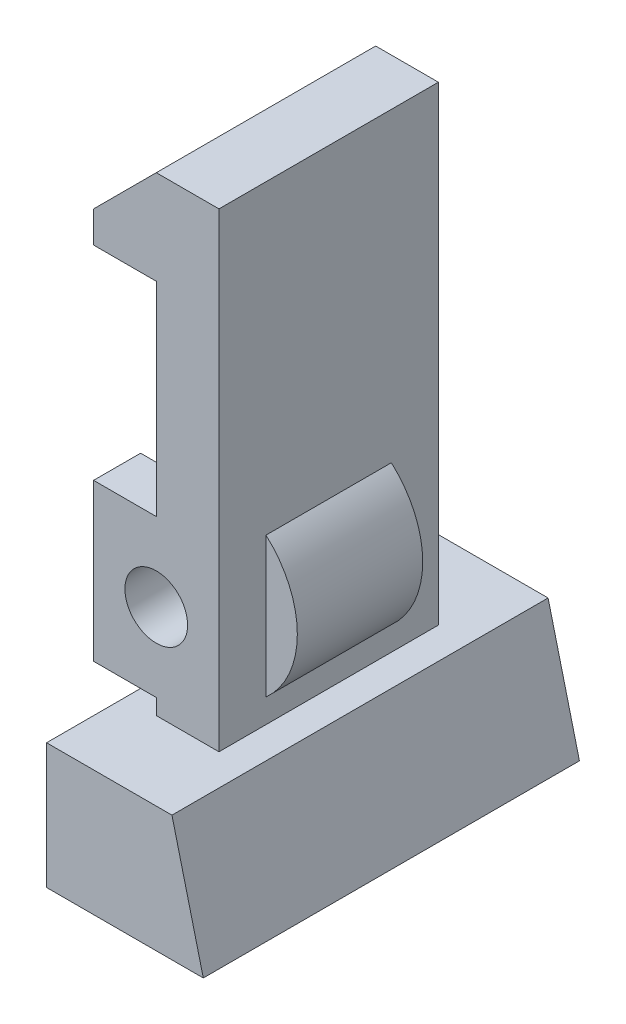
ISO-10303-21;
HEADER;
FILE_DESCRIPTION(('STEP AP214'),'2;1');
FILE_NAME('part.step','',(''),(''),'','','');
FILE_SCHEMA(('AUTOMOTIVE_DESIGN { 1 0 10303 214 1 1 1 1 }'));
ENDSEC;
DATA;
#1=APPLICATION_CONTEXT('core data for automotive mechanical design processes');
#2=APPLICATION_PROTOCOL_DEFINITION('international standard','automotive_design',2000,#1);
#3=PRODUCT_CONTEXT('',#1,'mechanical');
#4=PRODUCT('Part','Part','',(#3));
#5=PRODUCT_RELATED_PRODUCT_CATEGORY('part','',(#4));
#6=PRODUCT_DEFINITION_FORMATION('','',#4);
#7=PRODUCT_DEFINITION_CONTEXT('part definition',#1,'design');
#8=PRODUCT_DEFINITION('design','',#6,#7);
#9=PRODUCT_DEFINITION_SHAPE('','',#8);
#10=(LENGTH_UNIT() NAMED_UNIT(*) SI_UNIT(.MILLI.,.METRE.));
#11=(NAMED_UNIT(*) PLANE_ANGLE_UNIT() SI_UNIT($,.RADIAN.));
#12=(NAMED_UNIT(*) SI_UNIT($,.STERADIAN.) SOLID_ANGLE_UNIT());
#13=UNCERTAINTY_MEASURE_WITH_UNIT(LENGTH_MEASURE(1.E-05),#10,'distance_accuracy_value','');
#14=(GEOMETRIC_REPRESENTATION_CONTEXT(3) GLOBAL_UNCERTAINTY_ASSIGNED_CONTEXT((#13)) GLOBAL_UNIT_ASSIGNED_CONTEXT((#10,
#11,#12)) REPRESENTATION_CONTEXT('',''));
#15=CARTESIAN_POINT('',(0.,0.,0.));
#16=DIRECTION('',(0.,0.,1.));
#17=DIRECTION('',(1.,0.,0.));
#18=AXIS2_PLACEMENT_3D('',#15,#16,#17);
#19=CARTESIAN_POINT('',(0.,0.,3.5));
#20=DIRECTION('',(1.,0.,0.));
#21=DIRECTION('',(0.,1.,0.));
#22=AXIS2_PLACEMENT_3D('',#19,#20,#21);
#23=PLANE('',#22);
#24=DIRECTION('',(0.,1.,0.));
#25=VECTOR('',#24,1.);
#26=CARTESIAN_POINT('',(0.,2.5,-2.));
#27=LINE('',#26,#25);
#28=CARTESIAN_POINT('',(0.,1.,-2.));
#29=VERTEX_POINT('',#28);
#30=CARTESIAN_POINT('',(0.,2.5,-2.));
#31=VERTEX_POINT('',#30);
#32=EDGE_CURVE('E199',#29,#31,#27,.T.);
#33=ORIENTED_EDGE('',*,*,#32,.F.);
#34=DIRECTION('',(0.,0.,1.));
#35=VECTOR('',#34,1.);
#36=CARTESIAN_POINT('',(0.,1.,-6.00000000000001));
#37=LINE('',#36,#35);
#38=CARTESIAN_POINT('',(0.,1.,2.));
#39=VERTEX_POINT('',#38);
#40=EDGE_CURVE('E45',#29,#39,#37,.T.);
#41=ORIENTED_EDGE('',*,*,#40,.T.);
#42=DIRECTION('',(0.,1.,0.));
#43=VECTOR('',#42,1.);
#44=CARTESIAN_POINT('',(0.,2.5,2.));
#45=LINE('',#44,#43);
#46=CARTESIAN_POINT('',(0.,2.5,2.));
#47=VERTEX_POINT('',#46);
#48=EDGE_CURVE('E231',#39,#47,#45,.T.);
#49=ORIENTED_EDGE('',*,*,#48,.T.);
#50=DIRECTION('',(0.,0.,1.));
#51=VECTOR('',#50,1.);
#52=CARTESIAN_POINT('',(0.,2.5,2.));
#53=LINE('',#52,#51);
#54=CARTESIAN_POINT('',(0.,2.5,3.5));
#55=VERTEX_POINT('',#54);
#56=EDGE_CURVE('E240',#47,#55,#53,.T.);
#57=ORIENTED_EDGE('',*,*,#56,.T.);
#58=DIRECTION('',(0.,-1.,0.));
#59=VECTOR('',#58,1.);
#60=CARTESIAN_POINT('',(0.,-3.,3.5));
#61=LINE('',#60,#59);
#62=CARTESIAN_POINT('',(0.,9.,3.5));
#63=VERTEX_POINT('',#62);
#64=EDGE_CURVE('E309',#63,#55,#61,.T.);
#65=ORIENTED_EDGE('',*,*,#64,.F.);
#66=DIRECTION('',(0.,0.,-1.));
#67=VECTOR('',#66,1.);
#68=CARTESIAN_POINT('',(0.,9.,3.5));
#69=LINE('',#68,#67);
#70=CARTESIAN_POINT('',(0.,9.,-3.5));
#71=VERTEX_POINT('',#70);
#72=EDGE_CURVE('E325',#63,#71,#69,.T.);
#73=ORIENTED_EDGE('',*,*,#72,.T.);
#74=DIRECTION('',(0.,-1.,0.));
#75=VECTOR('',#74,1.);
#76=CARTESIAN_POINT('',(0.,0.,-3.5));
#77=LINE('',#76,#75);
#78=CARTESIAN_POINT('',(0.,2.5,-3.5));
#79=VERTEX_POINT('',#78);
#80=EDGE_CURVE('E306',#71,#79,#77,.T.);
#81=ORIENTED_EDGE('',*,*,#80,.T.);
#82=DIRECTION('',(0.,0.,-1.));
#83=VECTOR('',#82,1.);
#84=CARTESIAN_POINT('',(0.,2.5,-2.));
#85=LINE('',#84,#83);
#86=EDGE_CURVE('E213',#31,#79,#85,.T.);
#87=ORIENTED_EDGE('',*,*,#86,.F.);
#88=EDGE_LOOP('',(#33,#41,#49,#57,#65,#73,#81,#87));
#89=FACE_BOUND('',#88,.T.);
#90=ADVANCED_FACE('F31',(#89),#23,.F.);
#91=CARTESIAN_POINT('',(0.,-2.5,2.));
#92=VERTEX_POINT('',#91);
#93=CARTESIAN_POINT('',(0.,-1.,2.));
#94=VERTEX_POINT('',#93);
#95=EDGE_CURVE('E193',#92,#94,#45,.T.);
#96=ORIENTED_EDGE('',*,*,#95,.T.);
#97=DIRECTION('',(0.,0.,1.));
#98=VECTOR('',#97,1.);
#99=CARTESIAN_POINT('',(0.,-1.,-6.00000000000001));
#100=LINE('',#99,#98);
#101=CARTESIAN_POINT('',(0.,-1.,-2.));
#102=VERTEX_POINT('',#101);
#103=EDGE_CURVE('E186',#94,#102,#100,.F.);
#104=ORIENTED_EDGE('',*,*,#103,.T.);
#105=CARTESIAN_POINT('',(0.,-2.5,-2.));
#106=VERTEX_POINT('',#105);
#107=EDGE_CURVE('E53',#106,#102,#27,.T.);
#108=ORIENTED_EDGE('',*,*,#107,.F.);
#109=DIRECTION('',(0.,0.,-1.));
#110=VECTOR('',#109,1.);
#111=CARTESIAN_POINT('',(0.,-2.5,-2.));
#112=LINE('',#111,#110);
#113=CARTESIAN_POINT('',(0.,-2.5,-3.5));
#114=VERTEX_POINT('',#113);
#115=EDGE_CURVE('E211',#106,#114,#112,.T.);
#116=ORIENTED_EDGE('',*,*,#115,.T.);
#117=CARTESIAN_POINT('',(0.,-3.,-3.5));
#118=VERTEX_POINT('',#117);
#119=EDGE_CURVE('E305',#114,#118,#77,.T.);
#120=ORIENTED_EDGE('',*,*,#119,.T.);
#121=DIRECTION('',(0.,0.,-1.));
#122=VECTOR('',#121,1.);
#123=CARTESIAN_POINT('',(0.,-3.,3.5));
#124=LINE('',#123,#122);
#125=CARTESIAN_POINT('',(0.,-3.,3.5));
#126=VERTEX_POINT('',#125);
#127=EDGE_CURVE('E39',#126,#118,#124,.T.);
#128=ORIENTED_EDGE('',*,*,#127,.F.);
#129=CARTESIAN_POINT('',(0.,-2.5,3.5));
#130=VERTEX_POINT('',#129);
#131=EDGE_CURVE('E308',#130,#126,#61,.T.);
#132=ORIENTED_EDGE('',*,*,#131,.F.);
#133=DIRECTION('',(0.,0.,1.));
#134=VECTOR('',#133,1.);
#135=CARTESIAN_POINT('',(0.,-2.5,2.));
#136=LINE('',#135,#134);
#137=EDGE_CURVE('E243',#92,#130,#136,.T.);
#138=ORIENTED_EDGE('',*,*,#137,.F.);
#139=EDGE_LOOP('',(#96,#104,#108,#116,#120,#128,#132,#138));
#140=FACE_BOUND('',#139,.T.);
#141=ADVANCED_FACE('F191',(#140),#23,.F.);
#142=CARTESIAN_POINT('',(2.,12.,3.5));
#143=DIRECTION('',(-1.,0.,0.));
#144=DIRECTION('',(0.,-1.,0.));
#145=AXIS2_PLACEMENT_3D('',#142,#143,#144);
#146=PLANE('',#145);
#147=DIRECTION('',(0.,0.,-1.));
#148=VECTOR('',#147,1.);
#149=CARTESIAN_POINT('',(2.,-2.23606797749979,2.));
#150=LINE('',#149,#148);
#151=CARTESIAN_POINT('',(2.,-2.23606797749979,2.));
#152=VERTEX_POINT('',#151);
#153=CARTESIAN_POINT('',(2.,-2.23606797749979,-2.));
#154=VERTEX_POINT('',#153);
#155=EDGE_CURVE('E257',#152,#154,#150,.T.);
#156=ORIENTED_EDGE('',*,*,#155,.F.);
#157=DIRECTION('',(0.,1.,0.));
#158=VECTOR('',#157,1.);
#159=CARTESIAN_POINT('',(2.,12.,2.));
#160=LINE('',#159,#158);
#161=CARTESIAN_POINT('',(2.,2.23606797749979,2.));
#162=VERTEX_POINT('',#161);
#163=EDGE_CURVE('E255',#152,#162,#160,.T.);
#164=ORIENTED_EDGE('',*,*,#163,.T.);
#165=DIRECTION('',(0.,0.,-1.));
#166=VECTOR('',#165,1.);
#167=CARTESIAN_POINT('',(2.,2.23606797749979,2.));
#168=LINE('',#167,#166);
#169=CARTESIAN_POINT('',(2.,2.23606797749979,-2.));
#170=VERTEX_POINT('',#169);
#171=EDGE_CURVE('E260',#170,#162,#168,.F.);
#172=ORIENTED_EDGE('',*,*,#171,.F.);
#173=DIRECTION('',(0.,1.,0.));
#174=VECTOR('',#173,1.);
#175=CARTESIAN_POINT('',(2.,12.,-2.));
#176=LINE('',#175,#174);
#177=EDGE_CURVE('E252',#154,#170,#176,.T.);
#178=ORIENTED_EDGE('',*,*,#177,.F.);
#179=EDGE_LOOP('',(#156,#164,#172,#178));
#180=FACE_BOUND('',#179,.T.);
#181=DIRECTION('',(0.,1.,0.));
#182=VECTOR('',#181,1.);
#183=CARTESIAN_POINT('',(2.,12.,-3.5));
#184=LINE('',#183,#182);
#185=CARTESIAN_POINT('',(2.,-3.,-3.5));
#186=VERTEX_POINT('',#185);
#187=CARTESIAN_POINT('',(2.,12.,-3.5));
#188=VERTEX_POINT('',#187);
#189=EDGE_CURVE('E295',#186,#188,#184,.T.);
#190=ORIENTED_EDGE('',*,*,#189,.T.);
#191=DIRECTION('',(0.,0.,-1.));
#192=VECTOR('',#191,1.);
#193=CARTESIAN_POINT('',(2.,12.,3.5));
#194=LINE('',#193,#192);
#195=CARTESIAN_POINT('',(2.,12.,3.5));
#196=VERTEX_POINT('',#195);
#197=EDGE_CURVE('E337',#196,#188,#194,.T.);
#198=ORIENTED_EDGE('',*,*,#197,.F.);
#199=DIRECTION('',(0.,1.,0.));
#200=VECTOR('',#199,1.);
#201=CARTESIAN_POINT('',(2.,12.,3.5));
#202=LINE('',#201,#200);
#203=CARTESIAN_POINT('',(2.,-3.,3.5));
#204=VERTEX_POINT('',#203);
#205=EDGE_CURVE('E314',#204,#196,#202,.T.);
#206=ORIENTED_EDGE('',*,*,#205,.F.);
#207=DIRECTION('',(0.,0.,-1.));
#208=VECTOR('',#207,1.);
#209=CARTESIAN_POINT('',(2.,-3.,3.5));
#210=LINE('',#209,#208);
#211=EDGE_CURVE('E340',#204,#186,#210,.T.);
#212=ORIENTED_EDGE('',*,*,#211,.T.);
#213=EDGE_LOOP('',(#190,#198,#206,#212));
#214=FACE_BOUND('',#213,.T.);
#215=ADVANCED_FACE('F33',(#180,#214),#146,.F.);
#216=CARTESIAN_POINT('',(0.,12.,3.5));
#217=DIRECTION('',(0.,-1.,0.));
#218=DIRECTION('',(0.,0.,-1.));
#219=AXIS2_PLACEMENT_3D('',#216,#217,#218);
#220=PLANE('',#219);
#221=DIRECTION('',(-1.,0.,0.));
#222=VECTOR('',#221,1.);
#223=CARTESIAN_POINT('',(0.,12.,-3.5));
#224=LINE('',#223,#222);
#225=CARTESIAN_POINT('',(0.,12.,-3.5));
#226=VERTEX_POINT('',#225);
#227=EDGE_CURVE('E297',#188,#226,#224,.T.);
#228=ORIENTED_EDGE('',*,*,#227,.T.);
#229=DIRECTION('',(0.,0.,-1.));
#230=VECTOR('',#229,1.);
#231=CARTESIAN_POINT('',(0.,12.,3.5));
#232=LINE('',#231,#230);
#233=CARTESIAN_POINT('',(0.,12.,3.5));
#234=VERTEX_POINT('',#233);
#235=EDGE_CURVE('E334',#234,#226,#232,.T.);
#236=ORIENTED_EDGE('',*,*,#235,.F.);
#237=DIRECTION('',(-1.,0.,0.));
#238=VECTOR('',#237,1.);
#239=CARTESIAN_POINT('',(0.,12.,3.5));
#240=LINE('',#239,#238);
#241=EDGE_CURVE('E316',#196,#234,#240,.T.);
#242=ORIENTED_EDGE('',*,*,#241,.F.);
#243=ORIENTED_EDGE('',*,*,#197,.T.);
#244=EDGE_LOOP('',(#228,#236,#242,#243));
#245=FACE_BOUND('',#244,.T.);
#246=ADVANCED_FACE('F424',(#245),#220,.F.);
#247=CARTESIAN_POINT('',(-2.,9.99999999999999,3.5));
#248=DIRECTION('',(0.707106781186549,-0.707106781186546,0.));
#249=DIRECTION('',(0.707106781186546,0.707106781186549,0.));
#250=AXIS2_PLACEMENT_3D('',#247,#248,#249);
#251=PLANE('',#250);
#252=DIRECTION('',(-0.707106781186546,-0.707106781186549,0.));
#253=VECTOR('',#252,1.);
#254=CARTESIAN_POINT('',(-2.,9.99999999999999,-3.5));
#255=LINE('',#254,#253);
#256=CARTESIAN_POINT('',(-2.,9.99999999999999,-3.5));
#257=VERTEX_POINT('',#256);
#258=EDGE_CURVE('E299',#226,#257,#255,.T.);
#259=ORIENTED_EDGE('',*,*,#258,.T.);
#260=DIRECTION('',(0.,0.,-1.));
#261=VECTOR('',#260,1.);
#262=CARTESIAN_POINT('',(-2.,9.99999999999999,3.5));
#263=LINE('',#262,#261);
#264=CARTESIAN_POINT('',(-2.,9.99999999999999,3.5));
#265=VERTEX_POINT('',#264);
#266=EDGE_CURVE('E331',#265,#257,#263,.T.);
#267=ORIENTED_EDGE('',*,*,#266,.F.);
#268=DIRECTION('',(-0.707106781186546,-0.707106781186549,0.));
#269=VECTOR('',#268,1.);
#270=CARTESIAN_POINT('',(-2.,9.99999999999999,3.5));
#271=LINE('',#270,#269);
#272=EDGE_CURVE('E318',#234,#265,#271,.T.);
#273=ORIENTED_EDGE('',*,*,#272,.F.);
#274=ORIENTED_EDGE('',*,*,#235,.T.);
#275=EDGE_LOOP('',(#259,#267,#273,#274));
#276=FACE_BOUND('',#275,.T.);
#277=ADVANCED_FACE('F421',(#276),#251,.F.);
#278=CARTESIAN_POINT('',(-2.,9.,3.5));
#279=DIRECTION('',(1.,0.,0.));
#280=DIRECTION('',(0.,0.,-1.));
#281=AXIS2_PLACEMENT_3D('',#278,#279,#280);
#282=PLANE('',#281);
#283=DIRECTION('',(0.,-1.,0.));
#284=VECTOR('',#283,1.);
#285=CARTESIAN_POINT('',(-2.,9.,-3.5));
#286=LINE('',#285,#284);
#287=CARTESIAN_POINT('',(-2.,9.,-3.5));
#288=VERTEX_POINT('',#287);
#289=EDGE_CURVE('E301',#257,#288,#286,.T.);
#290=ORIENTED_EDGE('',*,*,#289,.T.);
#291=DIRECTION('',(0.,0.,-1.));
#292=VECTOR('',#291,1.);
#293=CARTESIAN_POINT('',(-2.,9.,3.5));
#294=LINE('',#293,#292);
#295=CARTESIAN_POINT('',(-2.,9.,3.5));
#296=VERTEX_POINT('',#295);
#297=EDGE_CURVE('E328',#296,#288,#294,.T.);
#298=ORIENTED_EDGE('',*,*,#297,.F.);
#299=DIRECTION('',(0.,-1.,0.));
#300=VECTOR('',#299,1.);
#301=CARTESIAN_POINT('',(-2.,9.,3.5));
#302=LINE('',#301,#300);
#303=EDGE_CURVE('E320',#265,#296,#302,.T.);
#304=ORIENTED_EDGE('',*,*,#303,.F.);
#305=ORIENTED_EDGE('',*,*,#266,.T.);
#306=EDGE_LOOP('',(#290,#298,#304,#305));
#307=FACE_BOUND('',#306,.T.);
#308=ADVANCED_FACE('F418',(#307),#282,.F.);
#309=CARTESIAN_POINT('',(0.,9.,3.5));
#310=DIRECTION('',(0.,1.,0.));
#311=DIRECTION('',(-1.,0.,0.));
#312=AXIS2_PLACEMENT_3D('',#309,#310,#311);
#313=PLANE('',#312);
#314=DIRECTION('',(1.,0.,0.));
#315=VECTOR('',#314,1.);
#316=CARTESIAN_POINT('',(0.,9.,-3.5));
#317=LINE('',#316,#315);
#318=EDGE_CURVE('E303',#288,#71,#317,.T.);
#319=ORIENTED_EDGE('',*,*,#318,.T.);
#320=ORIENTED_EDGE('',*,*,#72,.F.);
#321=DIRECTION('',(1.,0.,0.));
#322=VECTOR('',#321,1.);
#323=CARTESIAN_POINT('',(0.,9.,3.5));
#324=LINE('',#323,#322);
#325=EDGE_CURVE('E322',#296,#63,#324,.T.);
#326=ORIENTED_EDGE('',*,*,#325,.F.);
#327=ORIENTED_EDGE('',*,*,#297,.T.);
#328=EDGE_LOOP('',(#319,#320,#326,#327));
#329=FACE_BOUND('',#328,.T.);
#330=ADVANCED_FACE('F414',(#329),#313,.F.);
#331=CARTESIAN_POINT('',(0.,12.,3.5));
#332=DIRECTION('',(0.,0.,-1.));
#333=DIRECTION('',(-1.,0.,0.));
#334=AXIS2_PLACEMENT_3D('',#331,#332,#333);
#335=PLANE('',#334);
#336=CARTESIAN_POINT('',(0.,0.,3.5));
#337=DIRECTION('',(0.,0.,-1.));
#338=DIRECTION('',(-1.,0.,0.));
#339=AXIS2_PLACEMENT_3D('',#336,#337,#338);
#340=CIRCLE('',#339,1.);
#341=CARTESIAN_POINT('',(-1.,0.,3.5));
#342=VERTEX_POINT('',#341);
#343=EDGE_CURVE('E385',#342,#342,#340,.T.);
#344=ORIENTED_EDGE('',*,*,#343,.T.);
#345=EDGE_LOOP('',(#344));
#346=FACE_BOUND('',#345,.T.);
#347=ORIENTED_EDGE('',*,*,#64,.T.);
#348=DIRECTION('',(-1.,0.,0.));
#349=VECTOR('',#348,1.);
#350=CARTESIAN_POINT('',(0.,2.5,3.5));
#351=LINE('',#350,#349);
#352=CARTESIAN_POINT('',(-2.,2.5,3.5));
#353=VERTEX_POINT('',#352);
#354=EDGE_CURVE('E222',#55,#353,#351,.T.);
#355=ORIENTED_EDGE('',*,*,#354,.T.);
#356=DIRECTION('',(0.,-1.,0.));
#357=VECTOR('',#356,1.);
#358=CARTESIAN_POINT('',(-2.,2.5,3.5));
#359=LINE('',#358,#357);
#360=CARTESIAN_POINT('',(-2.,-2.5,3.5));
#361=VERTEX_POINT('',#360);
#362=EDGE_CURVE('E210',#353,#361,#359,.T.);
#363=ORIENTED_EDGE('',*,*,#362,.T.);
#364=DIRECTION('',(1.,0.,0.));
#365=VECTOR('',#364,1.);
#366=CARTESIAN_POINT('',(-2.,-2.5,3.5));
#367=LINE('',#366,#365);
#368=EDGE_CURVE('E220',#361,#130,#367,.T.);
#369=ORIENTED_EDGE('',*,*,#368,.T.);
#370=ORIENTED_EDGE('',*,*,#131,.T.);
#371=DIRECTION('',(1.,0.,0.));
#372=VECTOR('',#371,1.);
#373=CARTESIAN_POINT('',(2.,-3.,3.5));
#374=LINE('',#373,#372);
#375=EDGE_CURVE('E312',#126,#204,#374,.T.);
#376=ORIENTED_EDGE('',*,*,#375,.T.);
#377=ORIENTED_EDGE('',*,*,#205,.T.);
#378=ORIENTED_EDGE('',*,*,#241,.T.);
#379=ORIENTED_EDGE('',*,*,#272,.T.);
#380=ORIENTED_EDGE('',*,*,#303,.T.);
#381=ORIENTED_EDGE('',*,*,#325,.T.);
#382=EDGE_LOOP('',(#347,#355,#363,#369,#370,#376,#377,#378,#379,#380,#381));
#383=FACE_BOUND('',#382,.T.);
#384=ADVANCED_FACE('F359',(#346,#383),#335,.F.);
#385=CARTESIAN_POINT('',(0.,12.,-3.5));
#386=DIRECTION('',(0.,0.,-1.));
#387=DIRECTION('',(-1.,0.,0.));
#388=AXIS2_PLACEMENT_3D('',#385,#386,#387);
#389=PLANE('',#388);
#390=CARTESIAN_POINT('',(0.,0.,-3.5));
#391=DIRECTION('',(0.,0.,-1.));
#392=DIRECTION('',(-1.,0.,0.));
#393=AXIS2_PLACEMENT_3D('',#390,#391,#392);
#394=CIRCLE('',#393,1.);
#395=CARTESIAN_POINT('',(-1.,0.,-3.5));
#396=VERTEX_POINT('',#395);
#397=EDGE_CURVE('E380',#396,#396,#394,.T.);
#398=ORIENTED_EDGE('',*,*,#397,.F.);
#399=EDGE_LOOP('',(#398));
#400=FACE_BOUND('',#399,.T.);
#401=DIRECTION('',(1.,0.,0.));
#402=VECTOR('',#401,1.);
#403=CARTESIAN_POINT('',(2.,-3.,-3.5));
#404=LINE('',#403,#402);
#405=EDGE_CURVE('E292',#118,#186,#404,.T.);
#406=ORIENTED_EDGE('',*,*,#405,.F.);
#407=ORIENTED_EDGE('',*,*,#119,.F.);
#408=DIRECTION('',(1.,0.,0.));
#409=VECTOR('',#408,1.);
#410=CARTESIAN_POINT('',(-2.,-2.5,-3.5));
#411=LINE('',#410,#409);
#412=CARTESIAN_POINT('',(-2.,-2.5,-3.5));
#413=VERTEX_POINT('',#412);
#414=EDGE_CURVE('E393',#413,#114,#411,.T.);
#415=ORIENTED_EDGE('',*,*,#414,.F.);
#416=DIRECTION('',(0.,-1.,0.));
#417=VECTOR('',#416,1.);
#418=CARTESIAN_POINT('',(-2.,2.5,-3.5));
#419=LINE('',#418,#417);
#420=CARTESIAN_POINT('',(-2.,2.5,-3.5));
#421=VERTEX_POINT('',#420);
#422=EDGE_CURVE('E388',#421,#413,#419,.T.);
#423=ORIENTED_EDGE('',*,*,#422,.F.);
#424=DIRECTION('',(-1.,0.,0.));
#425=VECTOR('',#424,1.);
#426=CARTESIAN_POINT('',(0.,2.5,-3.5));
#427=LINE('',#426,#425);
#428=EDGE_CURVE('E391',#79,#421,#427,.T.);
#429=ORIENTED_EDGE('',*,*,#428,.F.);
#430=ORIENTED_EDGE('',*,*,#80,.F.);
#431=ORIENTED_EDGE('',*,*,#318,.F.);
#432=ORIENTED_EDGE('',*,*,#289,.F.);
#433=ORIENTED_EDGE('',*,*,#258,.F.);
#434=ORIENTED_EDGE('',*,*,#227,.F.);
#435=ORIENTED_EDGE('',*,*,#189,.F.);
#436=EDGE_LOOP('',(#406,#407,#415,#423,#429,#430,#431,#432,#433,#434,#435));
#437=FACE_BOUND('',#436,.T.);
#438=ADVANCED_FACE('F351',(#400,#437),#389,.T.);
#439=CARTESIAN_POINT('',(2.,-3.,6.00000000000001));
#440=DIRECTION('',(0.,-1.,0.));
#441=DIRECTION('',(1.,0.,0.));
#442=AXIS2_PLACEMENT_3D('',#439,#440,#441);
#443=PLANE('',#442);
#444=DIRECTION('',(-1.,0.,0.));
#445=VECTOR('',#444,1.);
#446=CARTESIAN_POINT('',(2.,-3.,-6.00000000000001));
#447=LINE('',#446,#445);
#448=CARTESIAN_POINT('',(3.,-3.,-6.00000000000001));
#449=VERTEX_POINT('',#448);
#450=CARTESIAN_POINT('',(-1.,-3.,-6.00000000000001));
#451=VERTEX_POINT('',#450);
#452=EDGE_CURVE('E269',#449,#451,#447,.T.);
#453=ORIENTED_EDGE('',*,*,#452,.T.);
#454=DIRECTION('',(0.,0.,-1.));
#455=VECTOR('',#454,1.);
#456=CARTESIAN_POINT('',(-1.,-3.,6.00000000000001));
#457=LINE('',#456,#455);
#458=CARTESIAN_POINT('',(-1.,-3.,6.00000000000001));
#459=VERTEX_POINT('',#458);
#460=EDGE_CURVE('E289',#459,#451,#457,.T.);
#461=ORIENTED_EDGE('',*,*,#460,.F.);
#462=DIRECTION('',(-1.,0.,0.));
#463=VECTOR('',#462,1.);
#464=CARTESIAN_POINT('',(0.,-3.,6.00000000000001));
#465=LINE('',#464,#463);
#466=CARTESIAN_POINT('',(3.,-3.,6.00000000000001));
#467=VERTEX_POINT('',#466);
#468=EDGE_CURVE('E271',#467,#459,#465,.T.);
#469=ORIENTED_EDGE('',*,*,#468,.F.);
#470=DIRECTION('',(0.,0.,-1.));
#471=VECTOR('',#470,1.);
#472=CARTESIAN_POINT('',(3.,-3.,6.00000000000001));
#473=LINE('',#472,#471);
#474=EDGE_CURVE('E280',#467,#449,#473,.T.);
#475=ORIENTED_EDGE('',*,*,#474,.T.);
#476=EDGE_LOOP('',(#453,#461,#469,#475));
#477=FACE_BOUND('',#476,.T.);
#478=ORIENTED_EDGE('',*,*,#211,.F.);
#479=ORIENTED_EDGE('',*,*,#375,.F.);
#480=ORIENTED_EDGE('',*,*,#127,.T.);
#481=ORIENTED_EDGE('',*,*,#405,.T.);
#482=EDGE_LOOP('',(#478,#479,#480,#481));
#483=FACE_BOUND('',#482,.T.);
#484=ADVANCED_FACE('F348',(#477,#483),#443,.F.);
#485=CARTESIAN_POINT('',(-1.,-7.,6.00000000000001));
#486=DIRECTION('',(1.,0.,0.));
#487=DIRECTION('',(0.,0.,-1.));
#488=AXIS2_PLACEMENT_3D('',#485,#486,#487);
#489=PLANE('',#488);
#490=DIRECTION('',(0.,-1.,0.));
#491=VECTOR('',#490,1.);
#492=CARTESIAN_POINT('',(-1.,-7.,-6.00000000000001));
#493=LINE('',#492,#491);
#494=CARTESIAN_POINT('',(-1.,-7.,-6.00000000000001));
#495=VERTEX_POINT('',#494);
#496=EDGE_CURVE('E263',#451,#495,#493,.T.);
#497=ORIENTED_EDGE('',*,*,#496,.T.);
#498=DIRECTION('',(0.,0.,-1.));
#499=VECTOR('',#498,1.);
#500=CARTESIAN_POINT('',(-1.,-7.,6.00000000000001));
#501=LINE('',#500,#499);
#502=CARTESIAN_POINT('',(-1.,-7.,6.00000000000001));
#503=VERTEX_POINT('',#502);
#504=EDGE_CURVE('E286',#503,#495,#501,.T.);
#505=ORIENTED_EDGE('',*,*,#504,.F.);
#506=DIRECTION('',(0.,-1.,0.));
#507=VECTOR('',#506,1.);
#508=CARTESIAN_POINT('',(-1.,-7.,6.00000000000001));
#509=LINE('',#508,#507);
#510=EDGE_CURVE('E273',#459,#503,#509,.T.);
#511=ORIENTED_EDGE('',*,*,#510,.F.);
#512=ORIENTED_EDGE('',*,*,#460,.T.);
#513=EDGE_LOOP('',(#497,#505,#511,#512));
#514=FACE_BOUND('',#513,.T.);
#515=ADVANCED_FACE('F469',(#514),#489,.F.);
#516=CARTESIAN_POINT('',(4.,-7.,6.00000000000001));
#517=DIRECTION('',(0.,1.,0.));
#518=DIRECTION('',(-1.,0.,0.));
#519=AXIS2_PLACEMENT_3D('',#516,#517,#518);
#520=PLANE('',#519);
#521=DIRECTION('',(1.,0.,0.));
#522=VECTOR('',#521,1.);
#523=CARTESIAN_POINT('',(4.,-7.,-6.00000000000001));
#524=LINE('',#523,#522);
#525=CARTESIAN_POINT('',(4.,-7.,-6.00000000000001));
#526=VERTEX_POINT('',#525);
#527=EDGE_CURVE('E265',#495,#526,#524,.T.);
#528=ORIENTED_EDGE('',*,*,#527,.T.);
#529=DIRECTION('',(0.,0.,-1.));
#530=VECTOR('',#529,1.);
#531=CARTESIAN_POINT('',(4.,-7.,6.00000000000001));
#532=LINE('',#531,#530);
#533=CARTESIAN_POINT('',(4.,-7.,6.00000000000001));
#534=VERTEX_POINT('',#533);
#535=EDGE_CURVE('E283',#534,#526,#532,.T.);
#536=ORIENTED_EDGE('',*,*,#535,.F.);
#537=DIRECTION('',(1.,0.,0.));
#538=VECTOR('',#537,1.);
#539=CARTESIAN_POINT('',(4.,-7.,6.00000000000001));
#540=LINE('',#539,#538);
#541=EDGE_CURVE('E275',#503,#534,#540,.T.);
#542=ORIENTED_EDGE('',*,*,#541,.F.);
#543=ORIENTED_EDGE('',*,*,#504,.T.);
#544=EDGE_LOOP('',(#528,#536,#542,#543));
#545=FACE_BOUND('',#544,.T.);
#546=ADVANCED_FACE('F477',(#545),#520,.F.);
#547=CARTESIAN_POINT('',(3.,-3.,6.00000000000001));
#548=DIRECTION('',(-0.970142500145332,-0.242535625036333,0.));
#549=DIRECTION('',(0.242535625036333,-0.970142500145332,0.));
#550=AXIS2_PLACEMENT_3D('',#547,#548,#549);
#551=PLANE('',#550);
#552=DIRECTION('',(-0.242535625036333,0.970142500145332,0.));
#553=VECTOR('',#552,1.);
#554=CARTESIAN_POINT('',(3.,-3.,-6.00000000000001));
#555=LINE('',#554,#553);
#556=EDGE_CURVE('E267',#526,#449,#555,.T.);
#557=ORIENTED_EDGE('',*,*,#556,.T.);
#558=ORIENTED_EDGE('',*,*,#474,.F.);
#559=DIRECTION('',(-0.242535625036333,0.970142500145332,0.));
#560=VECTOR('',#559,1.);
#561=CARTESIAN_POINT('',(3.,-3.,6.00000000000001));
#562=LINE('',#561,#560);
#563=EDGE_CURVE('E277',#534,#467,#562,.T.);
#564=ORIENTED_EDGE('',*,*,#563,.F.);
#565=ORIENTED_EDGE('',*,*,#535,.T.);
#566=EDGE_LOOP('',(#557,#558,#564,#565));
#567=FACE_BOUND('',#566,.T.);
#568=ADVANCED_FACE('F485',(#567),#551,.F.);
#569=CARTESIAN_POINT('',(-1.,-3.,6.00000000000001));
#570=DIRECTION('',(0.,0.,1.));
#571=DIRECTION('',(1.,0.,0.));
#572=AXIS2_PLACEMENT_3D('',#569,#570,#571);
#573=PLANE('',#572);
#574=ORIENTED_EDGE('',*,*,#468,.T.);
#575=ORIENTED_EDGE('',*,*,#510,.T.);
#576=ORIENTED_EDGE('',*,*,#541,.T.);
#577=ORIENTED_EDGE('',*,*,#563,.T.);
#578=EDGE_LOOP('',(#574,#575,#576,#577));
#579=FACE_BOUND('',#578,.T.);
#580=ADVANCED_FACE('F493',(#579),#573,.T.);
#581=CARTESIAN_POINT('',(-1.,-3.,-6.00000000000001));
#582=DIRECTION('',(0.,0.,1.));
#583=DIRECTION('',(1.,0.,0.));
#584=AXIS2_PLACEMENT_3D('',#581,#582,#583);
#585=PLANE('',#584);
#586=ORIENTED_EDGE('',*,*,#496,.F.);
#587=ORIENTED_EDGE('',*,*,#452,.F.);
#588=ORIENTED_EDGE('',*,*,#556,.F.);
#589=ORIENTED_EDGE('',*,*,#527,.F.);
#590=EDGE_LOOP('',(#586,#587,#588,#589));
#591=FACE_BOUND('',#590,.T.);
#592=ADVANCED_FACE('F501',(#591),#585,.F.);
#593=CARTESIAN_POINT('',(0.,0.,2.));
#594=DIRECTION('',(0.,0.,-1.));
#595=DIRECTION('',(-1.,0.,0.));
#596=AXIS2_PLACEMENT_3D('',#593,#594,#595);
#597=CYLINDRICAL_SURFACE('',#596,3.);
#598=CARTESIAN_POINT('',(0.,0.,-2.));
#599=DIRECTION('',(0.,0.,1.));
#600=DIRECTION('',(1.,0.,0.));
#601=AXIS2_PLACEMENT_3D('',#598,#599,#600);
#602=CIRCLE('',#601,3.);
#603=EDGE_CURVE('E239',#154,#170,#602,.T.);
#604=ORIENTED_EDGE('',*,*,#603,.T.);
#605=ORIENTED_EDGE('',*,*,#171,.T.);
#606=CARTESIAN_POINT('',(0.,0.,2.));
#607=DIRECTION('',(0.,0.,1.));
#608=DIRECTION('',(1.,0.,0.));
#609=AXIS2_PLACEMENT_3D('',#606,#607,#608);
#610=CIRCLE('',#609,3.);
#611=EDGE_CURVE('E249',#152,#162,#610,.T.);
#612=ORIENTED_EDGE('',*,*,#611,.F.);
#613=ORIENTED_EDGE('',*,*,#155,.T.);
#614=EDGE_LOOP('',(#604,#605,#612,#613));
#615=FACE_BOUND('',#614,.T.);
#616=ADVANCED_FACE('F509',(#615),#597,.T.);
#617=CARTESIAN_POINT('',(0.,0.,2.));
#618=DIRECTION('',(0.,0.,1.));
#619=DIRECTION('',(1.,0.,0.));
#620=AXIS2_PLACEMENT_3D('',#617,#618,#619);
#621=PLANE('',#620);
#622=ORIENTED_EDGE('',*,*,#163,.F.);
#623=ORIENTED_EDGE('',*,*,#611,.T.);
#624=EDGE_LOOP('',(#622,#623));
#625=FACE_BOUND('',#624,.T.);
#626=ADVANCED_FACE('F517',(#625),#621,.T.);
#627=CARTESIAN_POINT('',(0.,0.,-2.));
#628=DIRECTION('',(0.,0.,1.));
#629=DIRECTION('',(1.,0.,0.));
#630=AXIS2_PLACEMENT_3D('',#627,#628,#629);
#631=PLANE('',#630);
#632=ORIENTED_EDGE('',*,*,#603,.F.);
#633=ORIENTED_EDGE('',*,*,#177,.T.);
#634=EDGE_LOOP('',(#632,#633));
#635=FACE_BOUND('',#634,.T.);
#636=ADVANCED_FACE('F525',(#635),#631,.F.);
#637=CARTESIAN_POINT('',(-2.,2.5,2.));
#638=DIRECTION('',(-1.,0.,0.));
#639=DIRECTION('',(0.,-1.,0.));
#640=AXIS2_PLACEMENT_3D('',#637,#638,#639);
#641=PLANE('',#640);
#642=ORIENTED_EDGE('',*,*,#362,.F.);
#643=DIRECTION('',(0.,0.,1.));
#644=VECTOR('',#643,1.);
#645=CARTESIAN_POINT('',(-2.,2.5,2.));
#646=LINE('',#645,#644);
#647=CARTESIAN_POINT('',(-2.,2.5,2.));
#648=VERTEX_POINT('',#647);
#649=EDGE_CURVE('E237',#648,#353,#646,.T.);
#650=ORIENTED_EDGE('',*,*,#649,.F.);
#651=DIRECTION('',(0.,-1.,0.));
#652=VECTOR('',#651,1.);
#653=CARTESIAN_POINT('',(-2.,2.5,2.));
#654=LINE('',#653,#652);
#655=CARTESIAN_POINT('',(-2.,-2.5,2.));
#656=VERTEX_POINT('',#655);
#657=EDGE_CURVE('E225',#648,#656,#654,.T.);
#658=ORIENTED_EDGE('',*,*,#657,.T.);
#659=DIRECTION('',(0.,0.,1.));
#660=VECTOR('',#659,1.);
#661=CARTESIAN_POINT('',(-2.,-2.5,2.));
#662=LINE('',#661,#660);
#663=EDGE_CURVE('E236',#656,#361,#662,.T.);
#664=ORIENTED_EDGE('',*,*,#663,.T.);
#665=EDGE_LOOP('',(#642,#650,#658,#664));
#666=FACE_BOUND('',#665,.T.);
#667=ADVANCED_FACE('F371',(#666),#641,.T.);
#668=CARTESIAN_POINT('',(0.,2.5,2.));
#669=DIRECTION('',(0.,1.,0.));
#670=DIRECTION('',(-1.,0.,0.));
#671=AXIS2_PLACEMENT_3D('',#668,#669,#670);
#672=PLANE('',#671);
#673=ORIENTED_EDGE('',*,*,#354,.F.);
#674=ORIENTED_EDGE('',*,*,#56,.F.);
#675=DIRECTION('',(-1.,0.,0.));
#676=VECTOR('',#675,1.);
#677=CARTESIAN_POINT('',(0.,2.5,2.));
#678=LINE('',#677,#676);
#679=EDGE_CURVE('E233',#47,#648,#678,.T.);
#680=ORIENTED_EDGE('',*,*,#679,.T.);
#681=ORIENTED_EDGE('',*,*,#649,.T.);
#682=EDGE_LOOP('',(#673,#674,#680,#681));
#683=FACE_BOUND('',#682,.T.);
#684=ADVANCED_FACE('F373',(#683),#672,.T.);
#685=CARTESIAN_POINT('',(-2.,-2.5,2.));
#686=DIRECTION('',(0.,-1.,0.));
#687=DIRECTION('',(0.,0.,-1.));
#688=AXIS2_PLACEMENT_3D('',#685,#686,#687);
#689=PLANE('',#688);
#690=ORIENTED_EDGE('',*,*,#368,.F.);
#691=ORIENTED_EDGE('',*,*,#663,.F.);
#692=DIRECTION('',(1.,0.,0.));
#693=VECTOR('',#692,1.);
#694=CARTESIAN_POINT('',(-2.,-2.5,2.));
#695=LINE('',#694,#693);
#696=EDGE_CURVE('E228',#656,#92,#695,.T.);
#697=ORIENTED_EDGE('',*,*,#696,.T.);
#698=ORIENTED_EDGE('',*,*,#137,.T.);
#699=EDGE_LOOP('',(#690,#691,#697,#698));
#700=FACE_BOUND('',#699,.T.);
#701=ADVANCED_FACE('F363',(#700),#689,.T.);
#702=CARTESIAN_POINT('',(-2.,2.5,2.));
#703=DIRECTION('',(0.,0.,-1.));
#704=DIRECTION('',(-1.,0.,0.));
#705=AXIS2_PLACEMENT_3D('',#702,#703,#704);
#706=PLANE('',#705);
#707=CARTESIAN_POINT('',(0.,0.,2.));
#708=DIRECTION('',(0.,0.,-1.));
#709=DIRECTION('',(-1.,0.,0.));
#710=AXIS2_PLACEMENT_3D('',#707,#708,#709);
#711=CIRCLE('',#710,1.);
#712=EDGE_CURVE('E376',#94,#39,#711,.T.);
#713=ORIENTED_EDGE('',*,*,#712,.F.);
#714=ORIENTED_EDGE('',*,*,#95,.F.);
#715=ORIENTED_EDGE('',*,*,#696,.F.);
#716=ORIENTED_EDGE('',*,*,#657,.F.);
#717=ORIENTED_EDGE('',*,*,#679,.F.);
#718=ORIENTED_EDGE('',*,*,#48,.F.);
#719=EDGE_LOOP('',(#713,#714,#715,#716,#717,#718));
#720=FACE_BOUND('',#719,.T.);
#721=ADVANCED_FACE('F367',(#720),#706,.T.);
#722=CARTESIAN_POINT('',(-2.,2.5,-2.));
#723=DIRECTION('',(1.,0.,0.));
#724=DIRECTION('',(0.,1.,0.));
#725=AXIS2_PLACEMENT_3D('',#722,#723,#724);
#726=PLANE('',#725);
#727=ORIENTED_EDGE('',*,*,#422,.T.);
#728=DIRECTION('',(0.,0.,-1.));
#729=VECTOR('',#728,1.);
#730=CARTESIAN_POINT('',(-2.,-2.5,-2.));
#731=LINE('',#730,#729);
#732=CARTESIAN_POINT('',(-2.,-2.5,-2.));
#733=VERTEX_POINT('',#732);
#734=EDGE_CURVE('E207',#733,#413,#731,.T.);
#735=ORIENTED_EDGE('',*,*,#734,.F.);
#736=DIRECTION('',(0.,-1.,0.));
#737=VECTOR('',#736,1.);
#738=CARTESIAN_POINT('',(-2.,2.5,-2.));
#739=LINE('',#738,#737);
#740=CARTESIAN_POINT('',(-2.,2.5,-2.));
#741=VERTEX_POINT('',#740);
#742=EDGE_CURVE('E395',#741,#733,#739,.T.);
#743=ORIENTED_EDGE('',*,*,#742,.F.);
#744=DIRECTION('',(0.,0.,-1.));
#745=VECTOR('',#744,1.);
#746=CARTESIAN_POINT('',(-2.,2.5,-2.));
#747=LINE('',#746,#745);
#748=EDGE_CURVE('E201',#741,#421,#747,.T.);
#749=ORIENTED_EDGE('',*,*,#748,.T.);
#750=EDGE_LOOP('',(#727,#735,#743,#749));
#751=FACE_BOUND('',#750,.T.);
#752=ADVANCED_FACE('F405',(#751),#726,.F.);
#753=CARTESIAN_POINT('',(-2.,-2.5,-2.));
#754=DIRECTION('',(0.,1.,0.));
#755=DIRECTION('',(0.,0.,1.));
#756=AXIS2_PLACEMENT_3D('',#753,#754,#755);
#757=PLANE('',#756);
#758=ORIENTED_EDGE('',*,*,#414,.T.);
#759=ORIENTED_EDGE('',*,*,#115,.F.);
#760=DIRECTION('',(1.,0.,0.));
#761=VECTOR('',#760,1.);
#762=CARTESIAN_POINT('',(-2.,-2.5,-2.));
#763=LINE('',#762,#761);
#764=EDGE_CURVE('E197',#733,#106,#763,.T.);
#765=ORIENTED_EDGE('',*,*,#764,.F.);
#766=ORIENTED_EDGE('',*,*,#734,.T.);
#767=EDGE_LOOP('',(#758,#759,#765,#766));
#768=FACE_BOUND('',#767,.T.);
#769=ADVANCED_FACE('F407',(#768),#757,.F.);
#770=CARTESIAN_POINT('',(0.,2.5,-2.));
#771=DIRECTION('',(0.,-1.,0.));
#772=DIRECTION('',(1.,0.,0.));
#773=AXIS2_PLACEMENT_3D('',#770,#771,#772);
#774=PLANE('',#773);
#775=ORIENTED_EDGE('',*,*,#428,.T.);
#776=ORIENTED_EDGE('',*,*,#748,.F.);
#777=DIRECTION('',(-1.,0.,0.));
#778=VECTOR('',#777,1.);
#779=CARTESIAN_POINT('',(0.,2.5,-2.));
#780=LINE('',#779,#778);
#781=EDGE_CURVE('E203',#31,#741,#780,.T.);
#782=ORIENTED_EDGE('',*,*,#781,.F.);
#783=ORIENTED_EDGE('',*,*,#86,.T.);
#784=EDGE_LOOP('',(#775,#776,#782,#783));
#785=FACE_BOUND('',#784,.T.);
#786=ADVANCED_FACE('F401',(#785),#774,.F.);
#787=CARTESIAN_POINT('',(-2.,2.5,-2.));
#788=DIRECTION('',(0.,0.,1.));
#789=DIRECTION('',(-1.,0.,0.));
#790=AXIS2_PLACEMENT_3D('',#787,#788,#789);
#791=PLANE('',#790);
#792=CARTESIAN_POINT('',(0.,0.,-2.));
#793=DIRECTION('',(0.,0.,1.));
#794=DIRECTION('',(1.,0.,0.));
#795=AXIS2_PLACEMENT_3D('',#792,#793,#794);
#796=CIRCLE('',#795,1.);
#797=EDGE_CURVE('E11',#29,#102,#796,.T.);
#798=ORIENTED_EDGE('',*,*,#797,.F.);
#799=ORIENTED_EDGE('',*,*,#32,.T.);
#800=ORIENTED_EDGE('',*,*,#781,.T.);
#801=ORIENTED_EDGE('',*,*,#742,.T.);
#802=ORIENTED_EDGE('',*,*,#764,.T.);
#803=ORIENTED_EDGE('',*,*,#107,.T.);
#804=EDGE_LOOP('',(#798,#799,#800,#801,#802,#803));
#805=FACE_BOUND('',#804,.T.);
#806=ADVANCED_FACE('F195',(#805),#791,.T.);
#807=CARTESIAN_POINT('',(0.,0.,-6.00000000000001));
#808=DIRECTION('',(0.,0.,1.));
#809=DIRECTION('',(1.,0.,0.));
#810=AXIS2_PLACEMENT_3D('',#807,#808,#809);
#811=CYLINDRICAL_SURFACE('',#810,1.);
#812=ORIENTED_EDGE('',*,*,#712,.T.);
#813=ORIENTED_EDGE('',*,*,#40,.F.);
#814=ORIENTED_EDGE('',*,*,#797,.T.);
#815=ORIENTED_EDGE('',*,*,#103,.F.);
#816=EDGE_LOOP('',(#812,#813,#814,#815));
#817=FACE_BOUND('',#816,.T.);
#818=ORIENTED_EDGE('',*,*,#397,.T.);
#819=EDGE_LOOP('',(#818));
#820=FACE_BOUND('',#819,.T.);
#821=ORIENTED_EDGE('',*,*,#343,.F.);
#822=EDGE_LOOP('',(#821));
#823=FACE_BOUND('',#822,.T.);
#824=ADVANCED_FACE('F184',(#817,#820,#823),#811,.F.);
#825=CLOSED_SHELL('',(#90,#141,#215,#246,#277,#308,#330,#384,#438,#484,#515,#546,#568,#580,#592,
#616,#626,#636,#667,#684,#701,#721,#752,#769,#786,#806,#824));
#826=MANIFOLD_SOLID_BREP('B2',#825);
#827=ADVANCED_BREP_SHAPE_REPRESENTATION('',(#18,#826),#14);
#828=SHAPE_DEFINITION_REPRESENTATION(#9,#827);
ENDSEC;
END-ISO-10303-21;
